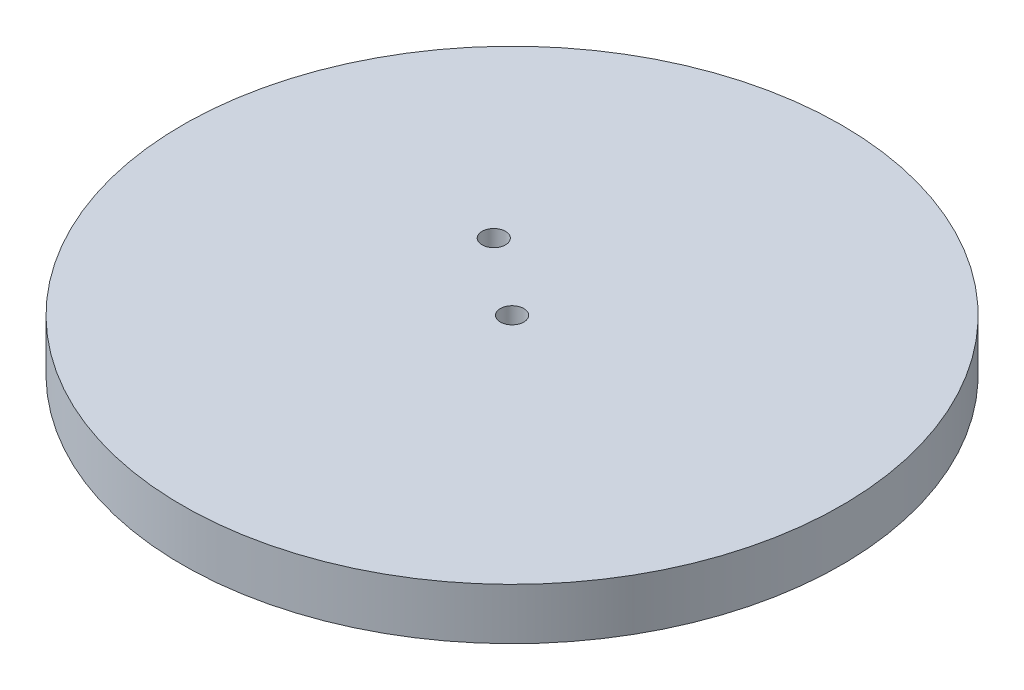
from build123d import *

# Parameters (mm, degrees)
SKIZZE2_R                       = 1.6
SCHNITT_LINEAR_AUSTRAGEN1_DEPTH = 10
VERRUNDUNG1_R                   = 2


with BuildPart() as part:
    # Skizze1 → Rotation1 (revolve)
    with BuildSketch(Plane(origin=(0, 0, 0), x_dir=(0, 0, -1), z_dir=(1, 0, 0))):
        with BuildLine():
            Line((1.6, 7), (1.6, 0))
            Line((1.6, 0), (1.6, -10.883014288))
            ThreePointArc((1.6, -10.883014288), (8.324662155, -7.190271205), (11, 0))
            Line((11, 0), (25.1, 0))
            Line((25.1, 0), (25.1, -3.533310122))
            Line((25.1, -3.533310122), (34.9, -3.533310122))
            Line((34.9, -3.533310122), (34.9, 0))
            Line((34.9, 0), (44.9, 0))
            Line((44.9, 0), (44.9, 7))
            Line((44.9, 7), (1.6, 7))
        make_face()
    revolve(axis=Axis((0, 0, 0), (0, 1, 0)))

    # Skizze2 → Schnitt-Linear austragen1 (cut)
    with BuildSketch(Plane(origin=(0, 0, 0), x_dir=(-1, 0, 0), z_dir=(0, -1, 0))):
        with Locations(Location((10.352815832, 7.862518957, 0), (0, 0, 90))):
            Circle(SKIZZE2_R)
    extrude(amount=-SCHNITT_LINEAR_AUSTRAGEN1_DEPTH, mode=Mode.SUBTRACT)

    # Verrundung1
    verrundung1_edges = [part.edges().sort_by_distance(p)[0] for p in [
        (0, -10.883014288, 1.6),
    ]]
    fillet(verrundung1_edges, radius=VERRUNDUNG1_R)


solid = part.part
